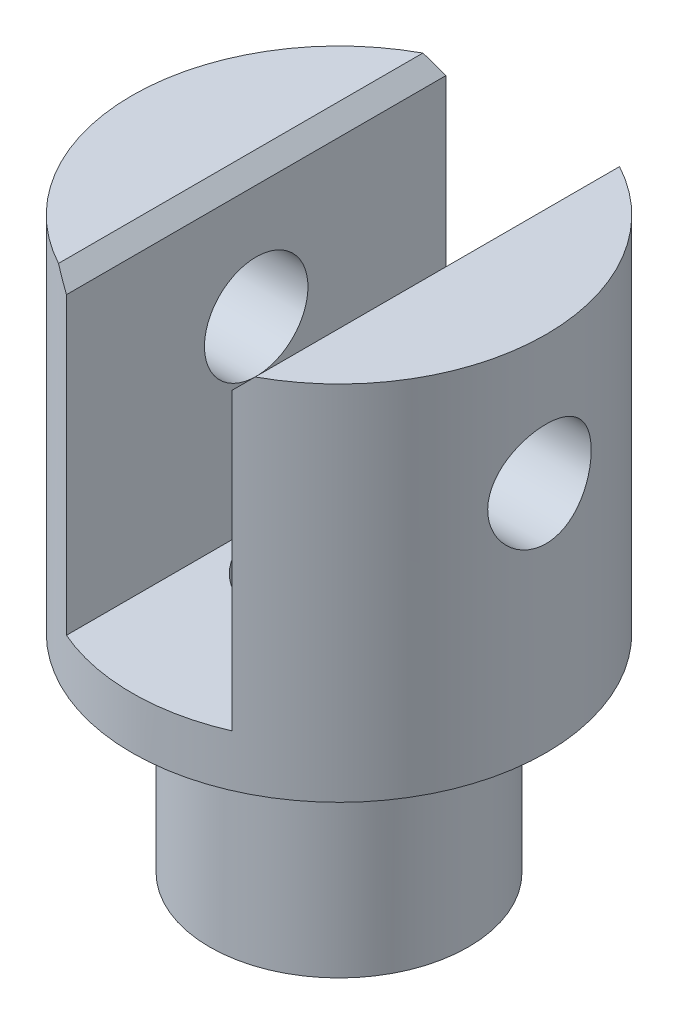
from build123d import *

# Parameters (mm, degrees)
ESQUISSE1_R                       = 4
BOSS_EXTRU_1_DEPTH                = 7
ESQUISSE2_R                       = 2.5
BOSS_EXTRU_2_DEPTH                = 4
ESQUISSE3_W                       = 3.2
ESQUISSE3_H                       = 9.927485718
ENL_V_MAT_EXTRU_1_DEPTH           = 6
DIAM_TRE_DU_PER_AGE_0_15_0_15_1_D = 3
DIAM_TRE_DU_PER_AGE_0_15_0_15_2_D = 2
CHANFREIN1_SIZE                   = 0.3


with BuildPart() as part:
    # Esquisse1 → Boss.-Extru.1 (new body)
    with BuildSketch(Plane(origin=(0, 0, 0), x_dir=(1, 0, 0), z_dir=(0, 1, 0))):
        with Locations(Location((0, 0, 0), (0, 0, 270))):
            Circle(ESQUISSE1_R)
    extrude(amount=BOSS_EXTRU_1_DEPTH)

    # Esquisse2 → Boss.-Extru.2 (add)
    with BuildSketch(Plane.XZ):
        with Locations(Location((0, 0, 0), (0, 0, 90))):
            Circle(ESQUISSE2_R)
    extrude(amount=BOSS_EXTRU_2_DEPTH)

    # Esquisse3 → Enl_v. mat.-Extru.1 (cut)
    with BuildSketch(Plane(origin=(0, 7, 0), x_dir=(1, 0, 0), z_dir=(0, 1, 0))):
        Rectangle(ESQUISSE3_W, ESQUISSE3_H)
    extrude(amount=-ENL_V_MAT_EXTRU_1_DEPTH, mode=Mode.SUBTRACT)

    # Diam_tre du per_age _0.15 _0.15_1 (through all)
    with Locations(Plane(origin=(0, -4, 0), x_dir=(-1, 0, 0), z_dir=(0, -1, 0))):
        with Locations((0, 0)):
            Hole(DIAM_TRE_DU_PER_AGE_0_15_0_15_1_D / 2)

    # Diam_tre du per_age _0.15 _0.15_2 (through all)
    with Locations(Plane(origin=(-4, 0, 0), x_dir=(0, 0, -1), z_dir=(-1, 0, 0))):
        with Locations((0, -4.5)):
            Hole(DIAM_TRE_DU_PER_AGE_0_15_0_15_2_D / 2)

    # Chanfrein1
    chanfrein1_edges = [part.edges().sort_by_distance(p)[0] for p in [
        (-1.6, 7, 0),
        (1.6, 7, 0),
    ]]
    chamfer(chanfrein1_edges, length=CHANFREIN1_SIZE)


solid = part.part
